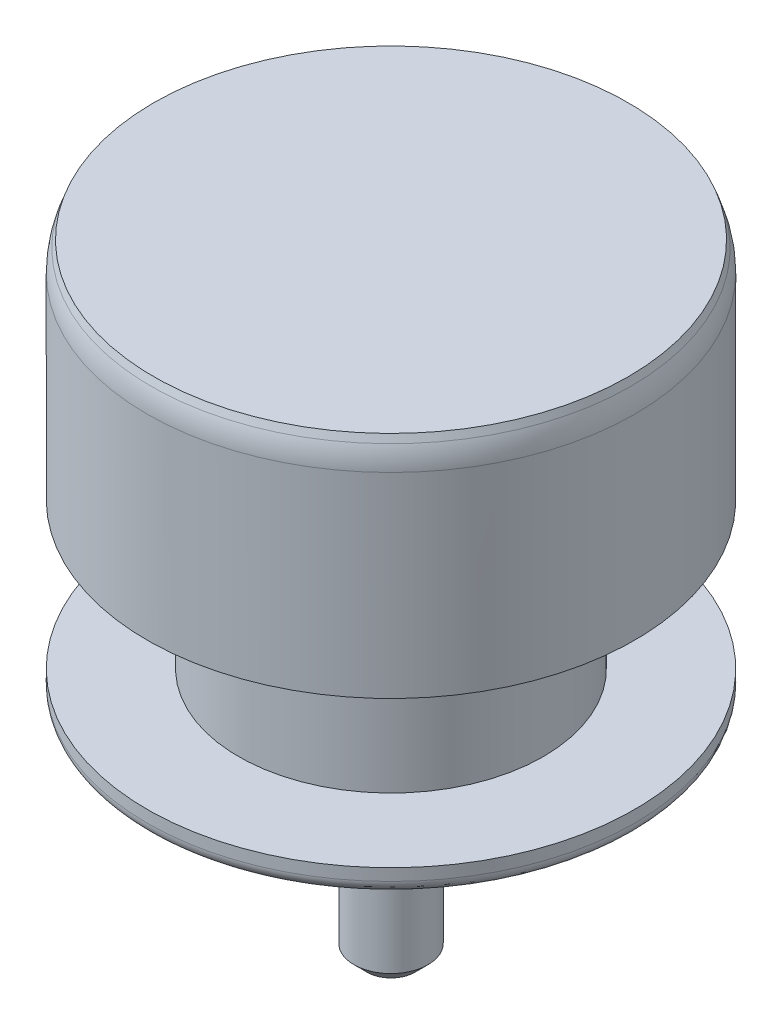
from build123d import *

# Parameters (mm, degrees)
FILLET1_R     = 0.2
FILLET2_R     = 1
CHAMFER1_SIZE = 0.2


with BuildPart() as part:
    # Sketch1 → Revolve1 (revolve)
    with BuildSketch(Plane.XY, mode=Mode.PRIVATE) as revolve1_sk:
        Polygon((0, 0), (0, -9.6), (0.57, -9.6), (0.57, -7.870910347), (3.76, -6.029162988), (3.76, -5.73), (2.35, -5.73), (2.35, -3.47), (3.76, -3.47), (3.76, -0.274747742), (3.66, 0), align=None)
    revolve(revolve1_sk.sketch.rotate(Axis((0, 0, 0), (0, -1, 0)), 180), axis=Axis((0, 0, 0), (0, -1, 0)))

    # Fillet1
    fillet1_edges = [part.edges().sort_by_distance(p)[0] for p in [
        (3.76, -6.029162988, 0),
    ]]
    fillet(fillet1_edges, radius=FILLET1_R)

    # Fillet2
    fillet2_edges = [part.edges().sort_by_distance(p)[0] for p in [
        (3.76, -0.274747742, 0),
    ]]
    fillet(fillet2_edges, radius=FILLET2_R)

    # Chamfer1
    chamfer1_edges = [part.edges().sort_by_distance(p)[0] for p in [
        (0.57, -9.6, 0),
    ]]
    chamfer(chamfer1_edges, length=CHAMFER1_SIZE)


solid = part.part
